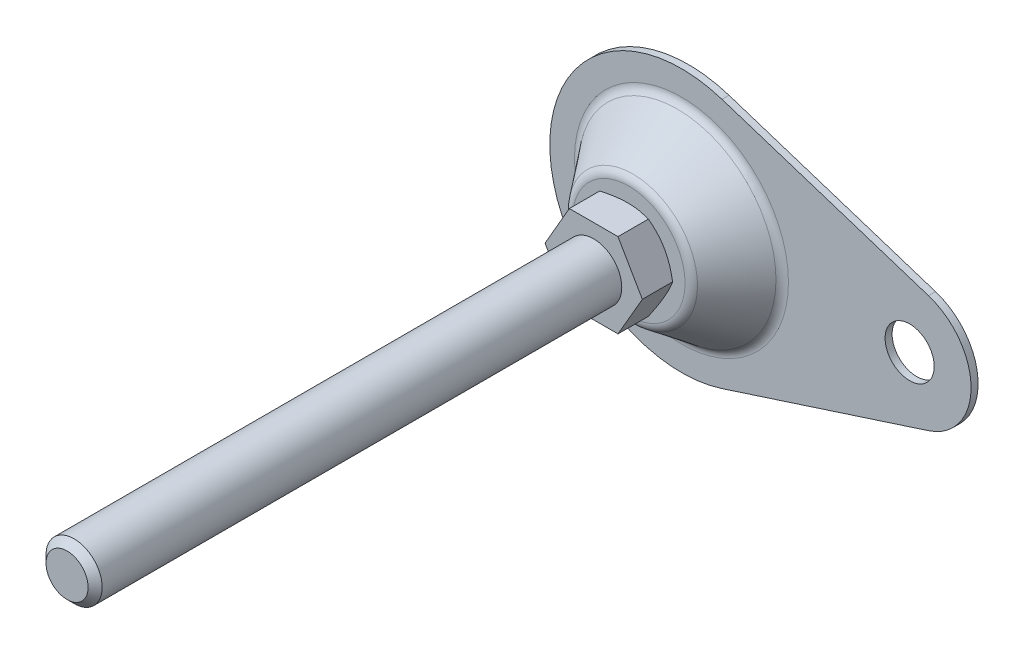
ISO-10303-21;
HEADER;
FILE_DESCRIPTION(('STEP AP214'),'2;1');
FILE_NAME('part.step','',(''),(''),'','','');
FILE_SCHEMA(('AUTOMOTIVE_DESIGN { 1 0 10303 214 1 1 1 1 }'));
ENDSEC;
DATA;
#1=APPLICATION_CONTEXT('core data for automotive mechanical design processes');
#2=APPLICATION_PROTOCOL_DEFINITION('international standard','automotive_design',2000,#1);
#3=PRODUCT_CONTEXT('',#1,'mechanical');
#4=PRODUCT('Part','Part','',(#3));
#5=PRODUCT_RELATED_PRODUCT_CATEGORY('part','',(#4));
#6=PRODUCT_DEFINITION_FORMATION('','',#4);
#7=PRODUCT_DEFINITION_CONTEXT('part definition',#1,'design');
#8=PRODUCT_DEFINITION('design','',#6,#7);
#9=PRODUCT_DEFINITION_SHAPE('','',#8);
#10=(LENGTH_UNIT() NAMED_UNIT(*) SI_UNIT(.MILLI.,.METRE.));
#11=(NAMED_UNIT(*) PLANE_ANGLE_UNIT() SI_UNIT($,.RADIAN.));
#12=(NAMED_UNIT(*) SI_UNIT($,.STERADIAN.) SOLID_ANGLE_UNIT());
#13=UNCERTAINTY_MEASURE_WITH_UNIT(LENGTH_MEASURE(1.E-05),#10,'distance_accuracy_value','');
#14=(GEOMETRIC_REPRESENTATION_CONTEXT(3) GLOBAL_UNCERTAINTY_ASSIGNED_CONTEXT((#13)) GLOBAL_UNIT_ASSIGNED_CONTEXT((#10,
#11,#12)) REPRESENTATION_CONTEXT('',''));
#15=CARTESIAN_POINT('',(0.,0.,0.));
#16=DIRECTION('',(0.,0.,1.));
#17=DIRECTION('',(1.,0.,0.));
#18=AXIS2_PLACEMENT_3D('',#15,#16,#17);
#19=CARTESIAN_POINT('',(65.,0.,2.));
#20=DIRECTION('',(0.,0.,1.));
#21=DIRECTION('',(1.,0.,0.));
#22=AXIS2_PLACEMENT_3D('',#19,#20,#21);
#23=PLANE('',#22);
#24=CARTESIAN_POINT('',(0.,0.,2.));
#25=DIRECTION('',(0.,0.,1.));
#26=DIRECTION('',(1.,0.,0.));
#27=AXIS2_PLACEMENT_3D('',#24,#25,#26);
#28=CIRCLE('',#27,30.4802116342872);
#29=CARTESIAN_POINT('',(30.4802116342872,0.,2.));
#30=VERTEX_POINT('',#29);
#31=EDGE_CURVE('E244',#30,#30,#28,.F.);
#32=ORIENTED_EDGE('',*,*,#31,.T.);
#33=EDGE_LOOP('',(#32));
#34=FACE_BOUND('',#33,.T.);
#35=CARTESIAN_POINT('',(65.,0.,2.));
#36=DIRECTION('',(0.,0.,1.));
#37=DIRECTION('',(1.,0.,0.));
#38=AXIS2_PLACEMENT_3D('',#35,#36,#37);
#39=CIRCLE('',#38,7.);
#40=CARTESIAN_POINT('',(72.,0.,2.));
#41=VERTEX_POINT('',#40);
#42=EDGE_CURVE('E261',#41,#41,#39,.T.);
#43=ORIENTED_EDGE('',*,*,#42,.F.);
#44=EDGE_LOOP('',(#43));
#45=FACE_BOUND('',#44,.T.);
#46=DIRECTION('',(-0.951485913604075,0.307692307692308,0.));
#47=VECTOR('',#46,1.);
#48=CARTESIAN_POINT('',(11.5384615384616,35.6807217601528,2.));
#49=LINE('',#48,#47);
#50=CARTESIAN_POINT('',(70.3846153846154,16.6510034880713,2.));
#51=VERTEX_POINT('',#50);
#52=CARTESIAN_POINT('',(11.5384615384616,35.6807217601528,2.));
#53=VERTEX_POINT('',#52);
#54=EDGE_CURVE('E112',#51,#53,#49,.T.);
#55=ORIENTED_EDGE('',*,*,#54,.T.);
#56=CARTESIAN_POINT('',(0.,0.,2.));
#57=DIRECTION('',(0.,0.,1.));
#58=DIRECTION('',(1.,0.,0.));
#59=AXIS2_PLACEMENT_3D('',#56,#57,#58);
#60=CIRCLE('',#59,37.5);
#61=CARTESIAN_POINT('',(11.5384615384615,-35.6807217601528,2.));
#62=VERTEX_POINT('',#61);
#63=EDGE_CURVE('E114',#53,#62,#60,.T.);
#64=ORIENTED_EDGE('',*,*,#63,.T.);
#65=DIRECTION('',(0.951485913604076,0.307692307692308,0.));
#66=VECTOR('',#65,1.);
#67=CARTESIAN_POINT('',(11.5384615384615,-35.6807217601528,2.));
#68=LINE('',#67,#66);
#69=CARTESIAN_POINT('',(70.3846153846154,-16.6510034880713,2.));
#70=VERTEX_POINT('',#69);
#71=EDGE_CURVE('E97',#62,#70,#68,.T.);
#72=ORIENTED_EDGE('',*,*,#71,.T.);
#73=CARTESIAN_POINT('',(65.,0.,2.));
#74=DIRECTION('',(0.,0.,1.));
#75=DIRECTION('',(1.,0.,0.));
#76=AXIS2_PLACEMENT_3D('',#73,#74,#75);
#77=CIRCLE('',#76,17.5);
#78=EDGE_CURVE('E106',#70,#51,#77,.T.);
#79=ORIENTED_EDGE('',*,*,#78,.T.);
#80=EDGE_LOOP('',(#55,#64,#72,#79));
#81=FACE_BOUND('',#80,.T.);
#82=ADVANCED_FACE('F14',(#34,#45,#81),#23,.T.);
#83=CARTESIAN_POINT('',(65.,0.,0.));
#84=DIRECTION('',(0.,0.,1.));
#85=DIRECTION('',(1.,0.,0.));
#86=AXIS2_PLACEMENT_3D('',#83,#84,#85);
#87=PLANE('',#86);
#88=CARTESIAN_POINT('',(65.,0.,0.));
#89=DIRECTION('',(0.,0.,1.));
#90=DIRECTION('',(1.,0.,0.));
#91=AXIS2_PLACEMENT_3D('',#88,#89,#90);
#92=CIRCLE('',#91,7.);
#93=CARTESIAN_POINT('',(72.,0.,0.));
#94=VERTEX_POINT('',#93);
#95=EDGE_CURVE('E257',#94,#94,#92,.T.);
#96=ORIENTED_EDGE('',*,*,#95,.T.);
#97=EDGE_LOOP('',(#96));
#98=FACE_BOUND('',#97,.T.);
#99=CARTESIAN_POINT('',(0.,0.,0.));
#100=DIRECTION('',(0.,0.,1.));
#101=DIRECTION('',(1.,0.,0.));
#102=AXIS2_PLACEMENT_3D('',#99,#100,#101);
#103=CIRCLE('',#102,37.5);
#104=CARTESIAN_POINT('',(11.5384615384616,35.6807217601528,0.));
#105=VERTEX_POINT('',#104);
#106=CARTESIAN_POINT('',(11.5384615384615,-35.6807217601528,0.));
#107=VERTEX_POINT('',#106);
#108=EDGE_CURVE('E274',#105,#107,#103,.T.);
#109=ORIENTED_EDGE('',*,*,#108,.F.);
#110=DIRECTION('',(-0.951485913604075,0.307692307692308,0.));
#111=VECTOR('',#110,1.);
#112=CARTESIAN_POINT('',(70.3846153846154,16.6510034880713,0.));
#113=LINE('',#112,#111);
#114=CARTESIAN_POINT('',(70.3846153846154,16.6510034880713,0.));
#115=VERTEX_POINT('',#114);
#116=EDGE_CURVE('E9',#115,#105,#113,.T.);
#117=ORIENTED_EDGE('',*,*,#116,.F.);
#118=CARTESIAN_POINT('',(65.,0.,0.));
#119=DIRECTION('',(0.,0.,1.));
#120=DIRECTION('',(1.,0.,0.));
#121=AXIS2_PLACEMENT_3D('',#118,#119,#120);
#122=CIRCLE('',#121,17.5);
#123=CARTESIAN_POINT('',(70.3846153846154,-16.6510034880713,0.));
#124=VERTEX_POINT('',#123);
#125=EDGE_CURVE('E22',#124,#115,#122,.T.);
#126=ORIENTED_EDGE('',*,*,#125,.F.);
#127=DIRECTION('',(0.951485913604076,0.307692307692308,0.));
#128=VECTOR('',#127,1.);
#129=CARTESIAN_POINT('',(70.3846153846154,-16.6510034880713,0.));
#130=LINE('',#129,#128);
#131=EDGE_CURVE('E99',#107,#124,#130,.T.);
#132=ORIENTED_EDGE('',*,*,#131,.F.);
#133=EDGE_LOOP('',(#109,#117,#126,#132));
#134=FACE_BOUND('',#133,.T.);
#135=ADVANCED_FACE('F215',(#98,#134),#87,.F.);
#136=CARTESIAN_POINT('',(0.,0.,17.));
#137=DIRECTION('',(0.,0.,-1.));
#138=DIRECTION('',(-1.,0.,0.));
#139=AXIS2_PLACEMENT_3D('',#136,#137,#138);
#140=PLANE('',#139);
#141=CARTESIAN_POINT('',(0.,0.,17.));
#142=DIRECTION('',(0.,0.,-1.));
#143=DIRECTION('',(-1.,0.,0.));
#144=AXIS2_PLACEMENT_3D('',#141,#142,#143);
#145=CIRCLE('',#144,16.0197883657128);
#146=CARTESIAN_POINT('',(-16.0197883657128,0.,17.));
#147=VERTEX_POINT('',#146);
#148=EDGE_CURVE('E277',#147,#147,#145,.F.);
#149=ORIENTED_EDGE('',*,*,#148,.T.);
#150=EDGE_LOOP('',(#149));
#151=FACE_BOUND('',#150,.T.);
#152=CARTESIAN_POINT('',(0.,0.,17.));
#153=DIRECTION('',(0.,0.,-1.));
#154=DIRECTION('',(-1.,0.,0.));
#155=AXIS2_PLACEMENT_3D('',#152,#153,#154);
#156=CIRCLE('',#155,11.5);
#157=CARTESIAN_POINT('',(-11.5,0.,17.));
#158=VERTEX_POINT('',#157);
#159=EDGE_CURVE('E122',#158,#158,#156,.T.);
#160=ORIENTED_EDGE('',*,*,#159,.T.);
#161=EDGE_LOOP('',(#160));
#162=FACE_BOUND('',#161,.T.);
#163=ADVANCED_FACE('F211',(#151,#162),#140,.F.);
#164=CARTESIAN_POINT('',(0.,0.,5.));
#165=DIRECTION('',(0.,0.,1.));
#166=DIRECTION('',(1.,0.,0.));
#167=AXIS2_PLACEMENT_3D('',#164,#165,#166);
#168=TOROIDAL_SURFACE('',#167,30.4802116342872,3.);
#169=CARTESIAN_POINT('',(0.,0.,3.1747053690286));
#170=DIRECTION('',(0.,0.,1.));
#171=DIRECTION('',(1.,0.,0.));
#172=AXIS2_PLACEMENT_3D('',#169,#170,#171);
#173=CIRCLE('',#172,28.0993925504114);
#174=CARTESIAN_POINT('',(28.0993925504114,0.,3.1747053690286));
#175=VERTEX_POINT('',#174);
#176=EDGE_CURVE('E241',#175,#175,#173,.T.);
#177=ORIENTED_EDGE('',*,*,#176,.F.);
#178=EDGE_LOOP('',(#177));
#179=FACE_BOUND('',#178,.T.);
#180=ORIENTED_EDGE('',*,*,#31,.F.);
#181=EDGE_LOOP('',(#180));
#182=FACE_BOUND('',#181,.T.);
#183=ADVANCED_FACE('F214',(#179,#182),#168,.F.);
#184=CARTESIAN_POINT('',(0.,0.,14.));
#185=DIRECTION('',(0.,0.,-1.));
#186=DIRECTION('',(-1.,0.,0.));
#187=AXIS2_PLACEMENT_3D('',#184,#185,#186);
#188=TOROIDAL_SURFACE('',#187,16.0197883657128,3.);
#189=ORIENTED_EDGE('',*,*,#148,.F.);
#190=EDGE_LOOP('',(#189));
#191=FACE_BOUND('',#190,.T.);
#192=CARTESIAN_POINT('',(0.,0.,15.8252946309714));
#193=DIRECTION('',(0.,0.,1.));
#194=DIRECTION('',(1.,0.,0.));
#195=AXIS2_PLACEMENT_3D('',#192,#193,#194);
#196=CIRCLE('',#195,18.4006074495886);
#197=CARTESIAN_POINT('',(18.4006074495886,0.,15.8252946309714));
#198=VERTEX_POINT('',#197);
#199=EDGE_CURVE('E250',#198,#198,#196,.F.);
#200=ORIENTED_EDGE('',*,*,#199,.F.);
#201=EDGE_LOOP('',(#200));
#202=FACE_BOUND('',#201,.T.);
#203=ADVANCED_FACE('F229',(#191,#202),#188,.T.);
#204=CARTESIAN_POINT('',(0.,0.,2.));
#205=DIRECTION('',(0.,0.,-1.));
#206=DIRECTION('',(-1.,0.,0.));
#207=AXIS2_PLACEMENT_3D('',#204,#205,#206);
#208=CYLINDRICAL_SURFACE('',#207,37.5);
#209=ORIENTED_EDGE('',*,*,#108,.T.);
#210=DIRECTION('',(0.,0.,1.));
#211=VECTOR('',#210,1.);
#212=CARTESIAN_POINT('',(11.5384615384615,-35.6807217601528,-8.));
#213=LINE('',#212,#211);
#214=EDGE_CURVE('E103',#107,#62,#213,.T.);
#215=ORIENTED_EDGE('',*,*,#214,.T.);
#216=ORIENTED_EDGE('',*,*,#63,.F.);
#217=DIRECTION('',(0.,0.,1.));
#218=VECTOR('',#217,1.);
#219=CARTESIAN_POINT('',(11.5384615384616,35.6807217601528,-8.));
#220=LINE('',#219,#218);
#221=EDGE_CURVE('E119',#105,#53,#220,.T.);
#222=ORIENTED_EDGE('',*,*,#221,.F.);
#223=EDGE_LOOP('',(#209,#215,#216,#222));
#224=FACE_BOUND('',#223,.T.);
#225=ADVANCED_FACE('F219',(#224),#208,.T.);
#226=CARTESIAN_POINT('',(65.,0.,2.));
#227=DIRECTION('',(0.,0.,-1.));
#228=DIRECTION('',(-1.,0.,0.));
#229=AXIS2_PLACEMENT_3D('',#226,#227,#228);
#230=CYLINDRICAL_SURFACE('',#229,7.);
#231=ORIENTED_EDGE('',*,*,#42,.T.);
#232=EDGE_LOOP('',(#231));
#233=FACE_BOUND('',#232,.T.);
#234=ORIENTED_EDGE('',*,*,#95,.F.);
#235=EDGE_LOOP('',(#234));
#236=FACE_BOUND('',#235,.T.);
#237=ADVANCED_FACE('F209',(#233,#236),#230,.F.);
#238=CARTESIAN_POINT('',(0.,0.,2.));
#239=DIRECTION('',(0.,0.,-1.));
#240=DIRECTION('',(-1.,0.,0.));
#241=AXIS2_PLACEMENT_3D('',#238,#239,#240);
#242=CONICAL_SURFACE('',#241,29.,0.654082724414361);
#243=ORIENTED_EDGE('',*,*,#176,.T.);
#244=EDGE_LOOP('',(#243));
#245=FACE_BOUND('',#244,.T.);
#246=ORIENTED_EDGE('',*,*,#199,.T.);
#247=EDGE_LOOP('',(#246));
#248=FACE_BOUND('',#247,.T.);
#249=ADVANCED_FACE('F151',(#245,#248),#242,.T.);
#250=CARTESIAN_POINT('',(0.,0.,17.));
#251=DIRECTION('',(0.,0.,1.));
#252=DIRECTION('',(1.,0.,0.));
#253=AXIS2_PLACEMENT_3D('',#250,#251,#252);
#254=CONICAL_SURFACE('',#253,11.5,1.0471975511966);
#255=ORIENTED_EDGE('',*,*,#159,.F.);
#256=EDGE_LOOP('',(#255));
#257=FACE_BOUND('',#256,.T.);
#258=CARTESIAN_POINT('',(13.8565219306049,0.000200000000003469,18.3605385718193));
#259=CARTESIAN_POINT('',(13.7042251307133,-0.263585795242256,18.2726247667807));
#260=CARTESIAN_POINT('',(13.5513604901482,-0.528355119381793,18.1887011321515));
#261=CARTESIAN_POINT('',(13.244405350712,-1.06001701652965,18.0299413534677));
#262=CARTESIAN_POINT('',(13.0903144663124,-1.32691025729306,17.9551081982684));
#263=CARTESIAN_POINT('',(12.6255589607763,-2.131890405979,17.745692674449));
#264=CARTESIAN_POINT('',(12.3130596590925,-2.67315507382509,17.6265783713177));
#265=CARTESIAN_POINT('',(11.8454187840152,-3.48313282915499,17.486906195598));
#266=CARTESIAN_POINT('',(11.6916742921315,-3.74942610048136,17.4471189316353));
#267=CARTESIAN_POINT('',(11.3834734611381,-4.28324559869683,17.3803985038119));
#268=CARTESIAN_POINT('',(11.2290171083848,-4.55077184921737,17.3534655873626));
#269=CARTESIAN_POINT('',(10.9198468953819,-5.08627036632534,17.3131437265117));
#270=CARTESIAN_POINT('',(10.7651335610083,-5.35424172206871,17.2997386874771));
#271=CARTESIAN_POINT('',(10.4555635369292,-5.89043273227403,17.286758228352));
#272=CARTESIAN_POINT('',(10.3007068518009,-6.15865237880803,17.2871823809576));
#273=CARTESIAN_POINT('',(10.0112020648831,-6.6600893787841,17.3008951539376));
#274=CARTESIAN_POINT('',(9.87653331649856,-6.89334249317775,17.3125111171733));
#275=CARTESIAN_POINT('',(9.60750555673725,-7.35931224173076,17.3459831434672));
#276=CARTESIAN_POINT('',(9.47314656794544,-7.59202883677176,17.367839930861));
#277=CARTESIAN_POINT('',(9.2048113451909,-8.05679907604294,17.4214125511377));
#278=CARTESIAN_POINT('',(9.07083551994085,-8.28885201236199,17.4531365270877));
#279=CARTESIAN_POINT('',(8.80351197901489,-8.75186996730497,17.5258869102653));
#280=CARTESIAN_POINT('',(8.67016430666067,-8.98283491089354,17.566913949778));
#281=CARTESIAN_POINT('',(8.2653799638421,-9.68394195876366,17.7049867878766));
#282=CARTESIAN_POINT('',(7.99511549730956,-10.1520537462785,17.8158000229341));
#283=CARTESIAN_POINT('',(7.45861659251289,-11.0812971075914,18.0673009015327));
#284=CARTESIAN_POINT('',(7.19237528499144,-11.5424405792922,18.2079294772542));
#285=CARTESIAN_POINT('',(6.92808776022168,-12.0002,18.3605385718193));
#286=B_SPLINE_CURVE_WITH_KNOTS('',3,(#258,#259,#260,#261,#262,#263,#264,#265,#266,#267,#268,
#269,#270,#271,#272,#273,#274,#275,#276,#277,#278,#279,#280,#281,#282,#283,#284,#285),
.UNSPECIFIED.,.F.,.F.,(4,2,2,2,2,2,2,2,2,2,2,2,2,4),(0.,0.951004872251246,1.90232158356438,
3.80900466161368,4.7389455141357,5.66890426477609,6.59775529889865,7.5265776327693,
8.33514643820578,9.14377244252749,9.95306755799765,10.7624176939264,12.4167102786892,
14.0677556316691),.UNSPECIFIED.);
#287=CARTESIAN_POINT('',(13.856406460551,0.,18.3604719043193));
#288=VERTEX_POINT('',#287);
#289=CARTESIAN_POINT('',(6.92820323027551,-12.,18.3604719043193));
#290=VERTEX_POINT('',#289);
#291=EDGE_CURVE('E29',#288,#290,#286,.T.);
#292=ORIENTED_EDGE('',*,*,#291,.T.);
#293=CARTESIAN_POINT('',(-18.6083655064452,-12.,23.1442020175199));
#294=CARTESIAN_POINT('',(-18.3462770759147,-12.,23.017036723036));
#295=CARTESIAN_POINT('',(-18.08388099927,-12.,22.8905057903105));
#296=CARTESIAN_POINT('',(-17.5584093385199,-12.,22.6388563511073));
#297=CARTESIAN_POINT('',(-17.2953337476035,-12.,22.5137378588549));
#298=CARTESIAN_POINT('',(-16.5049212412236,-12.,22.1406835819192));
#299=CARTESIAN_POINT('',(-15.9764762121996,-12.,21.8950867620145));
#300=CARTESIAN_POINT('',(-14.9131727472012,-12.,21.4102942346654));
#301=CARTESIAN_POINT('',(-14.3782950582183,-12.,21.1711406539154));
#302=CARTESIAN_POINT('',(-13.3042843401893,-12.,20.7026217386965));
#303=CARTESIAN_POINT('',(-12.7651515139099,-12.,20.4732559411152));
#304=CARTESIAN_POINT('',(-11.6645656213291,-12.,20.0198140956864));
#305=CARTESIAN_POINT('',(-11.1029472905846,-12.,19.796137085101));
#306=CARTESIAN_POINT('',(-9.97313609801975,-12.,19.365714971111));
#307=CARTESIAN_POINT('',(-9.40494250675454,-12.,19.1589717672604));
#308=CARTESIAN_POINT('',(-8.26215847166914,-12.,18.76784755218));
#309=CARTESIAN_POINT('',(-7.68758363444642,-12.,18.5834213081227));
#310=CARTESIAN_POINT('',(-6.5301387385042,-12.,18.2428386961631));
#311=CARTESIAN_POINT('',(-5.94727135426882,-12.,18.08667342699));
#312=CARTESIAN_POINT('',(-5.06821126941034,-12.,17.8796863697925));
#313=CARTESIAN_POINT('',(-4.77517718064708,-12.,17.8153682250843));
#314=CARTESIAN_POINT('',(-4.18710701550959,-12.,17.6965924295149));
#315=CARTESIAN_POINT('',(-3.89207098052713,-12.,17.6421345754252));
#316=CARTESIAN_POINT('',(-3.30020139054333,-12.,17.5440409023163));
#317=CARTESIAN_POINT('',(-3.00336786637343,-12.,17.5004048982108));
#318=CARTESIAN_POINT('',(-2.40821714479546,-12.,17.4248252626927));
#319=CARTESIAN_POINT('',(-2.10990000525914,-12.,17.3928811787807));
#320=CARTESIAN_POINT('',(-1.51609597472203,-12.,17.3417206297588));
#321=CARTESIAN_POINT('',(-1.22062302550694,-12.,17.3223433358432));
#322=CARTESIAN_POINT('',(-0.629123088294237,-12.,17.2961009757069));
#323=CARTESIAN_POINT('',(-0.333096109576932,-12.,17.289235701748));
#324=CARTESIAN_POINT('',(0.258986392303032,-12.,17.2881806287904));
#325=CARTESIAN_POINT('',(0.555041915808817,-12.,17.2939910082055));
#326=CARTESIAN_POINT('',(1.14664467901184,-12.,17.3181459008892));
#327=CARTESIAN_POINT('',(1.44219189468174,-12.,17.3364909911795));
#328=CARTESIAN_POINT('',(2.15236846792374,-12.,17.3952444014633));
#329=CARTESIAN_POINT('',(2.5665149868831,-12.,17.4415931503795));
#330=CARTESIAN_POINT('',(3.39173719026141,-12.,17.5563807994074));
#331=CARTESIAN_POINT('',(3.802812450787,-12.,17.6248226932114));
#332=CARTESIAN_POINT('',(4.62149256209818,-12.,17.781362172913));
#333=CARTESIAN_POINT('',(5.02909452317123,-12.,17.8694747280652));
#334=CARTESIAN_POINT('',(5.84021237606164,-12.,18.062669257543));
#335=CARTESIAN_POINT('',(6.24372832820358,-12.,18.1677509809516));
#336=CARTESIAN_POINT('',(7.05587544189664,-12.,18.3949035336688));
#337=CARTESIAN_POINT('',(7.46441269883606,-12.,18.5173077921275));
#338=CARTESIAN_POINT('',(8.27746088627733,-12.,18.7747613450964));
#339=CARTESIAN_POINT('',(8.68197178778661,-12.,18.9098107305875));
#340=CARTESIAN_POINT('',(9.4871716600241,-12.,19.1904097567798));
#341=CARTESIAN_POINT('',(9.887861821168,-12.,19.3359559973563));
#342=CARTESIAN_POINT('',(10.6859173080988,-12.,19.6358360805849));
#343=CARTESIAN_POINT('',(11.0832826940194,-12.,19.790169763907));
#344=CARTESIAN_POINT('',(12.1042233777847,-12.,20.1976080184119));
#345=CARTESIAN_POINT('',(12.7256146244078,-12.,20.4561802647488));
#346=CARTESIAN_POINT('',(13.9624742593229,-12.,20.987167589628));
#347=CARTESIAN_POINT('',(14.5779421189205,-12.,21.2595838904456));
#348=CARTESIAN_POINT('',(15.8042277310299,-12.,21.8151533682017));
#349=CARTESIAN_POINT('',(16.4150439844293,-12.,22.0983098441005));
#350=CARTESIAN_POINT('',(17.6327206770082,-12.,22.6729304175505));
#351=CARTESIAN_POINT('',(18.2395812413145,-12.,22.96439425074));
#352=CARTESIAN_POINT('',(19.4509184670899,-12.,23.5543128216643));
#353=CARTESIAN_POINT('',(20.0553907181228,-12.,23.852776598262));
#354=CARTESIAN_POINT('',(21.2616889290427,-12.,24.4550062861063));
#355=CARTESIAN_POINT('',(21.8635148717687,-12.,24.7587722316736));
#356=CARTESIAN_POINT('',(23.0648638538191,-12.,25.3705559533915));
#357=CARTESIAN_POINT('',(23.6643872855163,-12.,25.6785729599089));
#358=CARTESIAN_POINT('',(24.8616006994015,-12.,26.2981517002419));
#359=CARTESIAN_POINT('',(25.4592906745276,-12.,26.6097134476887));
#360=CARTESIAN_POINT('',(27.1338285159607,-12.,27.4878442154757));
#361=CARTESIAN_POINT('',(28.2089405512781,-12.,28.0577228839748));
#362=CARTESIAN_POINT('',(30.3554827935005,-12.,29.204483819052));
#363=CARTESIAN_POINT('',(31.4269128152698,-12.,29.781366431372));
#364=CARTESIAN_POINT('',(33.5637741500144,-12.,30.9386998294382));
#365=CARTESIAN_POINT('',(34.6292138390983,-12.,31.5191351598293));
#366=CARTESIAN_POINT('',(36.2256750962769,-12.,32.392803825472));
#367=CARTESIAN_POINT('',(36.7575282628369,-12.,32.6845196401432));
#368=CARTESIAN_POINT('',(37.8207382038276,-12.,33.2688529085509));
#369=CARTESIAN_POINT('',(38.3520949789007,-12.,33.5614703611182));
#370=CARTESIAN_POINT('',(38.8832332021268,-12.,33.8544840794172));
#371=B_SPLINE_CURVE_WITH_KNOTS('',3,(#293,#294,#295,#296,#297,#298,#299,#300,#301,#302,#303,
#304,#305,#306,#307,#308,#309,#310,#311,#312,#313,#314,#315,#316,#317,#318,#319,#320,#321,#322,
#323,#324,#325,#326,#327,#328,#329,#330,#331,#332,#333,#334,#335,#336,#337,#338,#339,#340,#341,
#342,#343,#344,#345,#346,#347,#348,#349,#350,#351,#352,#353,#354,#355,#356,#357,#358,#359,#360,
#361,#362,#363,#364,#365,#366,#367,#368,#369,#370),.UNSPECIFIED.,.F.,.F.,(4,2,2,2,2,2,2,2,2,2,2,
2,2,2,2,2,2,2,2,2,2,2,2,2,2,2,2,2,2,2,2,2,2,2,2,2,2,2,4),(0.,0.873927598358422,1.74786399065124,
3.49599571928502,5.25364432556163,7.01120967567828,8.82456645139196,10.6381263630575,
12.4479466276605,14.2571958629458,15.1570857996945,16.0569571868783,16.9568131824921,
17.8566343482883,18.7446997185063,19.6327503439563,20.5208134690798,21.408917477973,
22.6584225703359,23.9080970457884,25.1587257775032,26.4093360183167,27.6885323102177,
28.9677378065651,30.2465307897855,31.5253005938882,33.5441851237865,35.5632482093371,
37.5829365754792,39.6025607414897,41.6249545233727,43.6473614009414,45.6694068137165,
47.6914600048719,51.341851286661,54.9924235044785,58.6322742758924,60.4520794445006,
62.271882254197),.UNSPECIFIED.);
#372=CARTESIAN_POINT('',(-6.92820323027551,-12.,18.3604719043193));
#373=VERTEX_POINT('',#372);
#374=EDGE_CURVE('E158',#290,#373,#371,.F.);
#375=ORIENTED_EDGE('',*,*,#374,.T.);
#376=CARTESIAN_POINT('',(-6.92808776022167,-12.0002,18.3605385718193));
#377=CARTESIAN_POINT('',(-7.08038456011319,-11.7364142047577,18.2726247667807));
#378=CARTESIAN_POINT('',(-7.23324920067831,-11.4716448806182,18.1887011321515));
#379=CARTESIAN_POINT('',(-7.5402043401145,-10.9399829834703,18.0299413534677));
#380=CARTESIAN_POINT('',(-7.69429522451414,-10.6730897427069,17.9551081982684));
#381=CARTESIAN_POINT('',(-8.15905073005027,-9.868109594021,17.745692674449));
#382=CARTESIAN_POINT('',(-8.47155003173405,-9.32684492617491,17.6265783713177));
#383=CARTESIAN_POINT('',(-8.93919090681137,-8.51686717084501,17.486906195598));
#384=CARTESIAN_POINT('',(-9.09293539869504,-8.25057389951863,17.4471189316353));
#385=CARTESIAN_POINT('',(-9.40113622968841,-7.71675440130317,17.3803985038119));
#386=CARTESIAN_POINT('',(-9.55559258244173,-7.44922815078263,17.3534655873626));
#387=CARTESIAN_POINT('',(-9.86476279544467,-6.91372963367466,17.3131437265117));
#388=CARTESIAN_POINT('',(-10.0194761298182,-6.64575827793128,17.2997386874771));
#389=CARTESIAN_POINT('',(-10.3290461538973,-6.10956726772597,17.286758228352));
#390=CARTESIAN_POINT('',(-10.4839028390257,-5.84134762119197,17.2871823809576));
#391=CARTESIAN_POINT('',(-10.7734076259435,-5.3399106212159,17.3008951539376));
#392=CARTESIAN_POINT('',(-10.908076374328,-5.10665750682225,17.3125111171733));
#393=CARTESIAN_POINT('',(-11.1771041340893,-4.64068775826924,17.3459831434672));
#394=CARTESIAN_POINT('',(-11.3114631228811,-4.40797116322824,17.367839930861));
#395=CARTESIAN_POINT('',(-11.5797983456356,-3.94320092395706,17.4214125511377));
#396=CARTESIAN_POINT('',(-11.7137741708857,-3.711147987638,17.4531365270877));
#397=CARTESIAN_POINT('',(-11.9810977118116,-3.24813003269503,17.5258869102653));
#398=CARTESIAN_POINT('',(-12.1144453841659,-3.01716508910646,17.566913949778));
#399=CARTESIAN_POINT('',(-12.5192297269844,-2.31605804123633,17.7049867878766));
#400=CARTESIAN_POINT('',(-12.789494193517,-1.84794625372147,17.8158000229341));
#401=CARTESIAN_POINT('',(-13.3259930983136,-0.91870289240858,18.0673009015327));
#402=CARTESIAN_POINT('',(-13.5922344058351,-0.457559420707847,18.2079294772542));
#403=CARTESIAN_POINT('',(-13.8565219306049,0.000199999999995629,18.3605385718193));
#404=B_SPLINE_CURVE_WITH_KNOTS('',3,(#376,#377,#378,#379,#380,#381,#382,#383,#384,#385,#386,
#387,#388,#389,#390,#391,#392,#393,#394,#395,#396,#397,#398,#399,#400,#401,#402,#403),
.UNSPECIFIED.,.F.,.F.,(4,2,2,2,2,2,2,2,2,2,2,2,2,4),(0.,0.951004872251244,1.90232158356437,
3.80900466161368,4.7389455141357,5.66890426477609,6.59775529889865,7.5265776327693,
8.33514643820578,9.14377244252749,9.95306755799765,10.7624176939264,12.4167102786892,
14.0677556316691),.UNSPECIFIED.);
#405=CARTESIAN_POINT('',(-13.856406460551,0.,18.3604719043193));
#406=VERTEX_POINT('',#405);
#407=EDGE_CURVE('E127',#373,#406,#404,.T.);
#408=ORIENTED_EDGE('',*,*,#407,.T.);
#409=CARTESIAN_POINT('',(-13.8565219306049,-0.000200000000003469,18.3605385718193));
#410=CARTESIAN_POINT('',(-13.7042251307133,0.26358579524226,18.2726247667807));
#411=CARTESIAN_POINT('',(-13.5513604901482,0.528355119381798,18.1887011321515));
#412=CARTESIAN_POINT('',(-13.244405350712,1.06001701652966,18.0299413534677));
#413=CARTESIAN_POINT('',(-13.0903144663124,1.32691025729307,17.9551081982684));
#414=CARTESIAN_POINT('',(-12.6255589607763,2.13189040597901,17.745692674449));
#415=CARTESIAN_POINT('',(-12.3130596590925,2.6731550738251,17.6265783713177));
#416=CARTESIAN_POINT('',(-11.8454187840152,3.483132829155,17.486906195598));
#417=CARTESIAN_POINT('',(-11.6916742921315,3.74942610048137,17.4471189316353));
#418=CARTESIAN_POINT('',(-11.3834734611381,4.28324559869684,17.3803985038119));
#419=CARTESIAN_POINT('',(-11.2290171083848,4.55077184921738,17.3534655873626));
#420=CARTESIAN_POINT('',(-10.9198468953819,5.08627036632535,17.3131437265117));
#421=CARTESIAN_POINT('',(-10.7651335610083,5.35424172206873,17.2997386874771));
#422=CARTESIAN_POINT('',(-10.4555635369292,5.89043273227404,17.286758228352));
#423=CARTESIAN_POINT('',(-10.3007068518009,6.15865237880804,17.2871823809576));
#424=CARTESIAN_POINT('',(-10.0112020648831,6.66008937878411,17.3008951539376));
#425=CARTESIAN_POINT('',(-9.87653331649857,6.89334249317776,17.3125111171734));
#426=CARTESIAN_POINT('',(-9.60750555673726,7.35931224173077,17.3459831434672));
#427=CARTESIAN_POINT('',(-9.47314656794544,7.59202883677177,17.367839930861));
#428=CARTESIAN_POINT('',(-9.20481134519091,8.05679907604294,17.4214125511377));
#429=CARTESIAN_POINT('',(-9.07083551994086,8.288852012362,17.4531365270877));
#430=CARTESIAN_POINT('',(-8.8035119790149,8.75186996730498,17.5258869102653));
#431=CARTESIAN_POINT('',(-8.67016430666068,8.98283491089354,17.566913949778));
#432=CARTESIAN_POINT('',(-8.26537996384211,9.68394195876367,17.7049867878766));
#433=CARTESIAN_POINT('',(-7.99511549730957,10.1520537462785,17.8158000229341));
#434=CARTESIAN_POINT('',(-7.4586165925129,11.0812971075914,18.0673009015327));
#435=CARTESIAN_POINT('',(-7.19237528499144,11.5424405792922,18.2079294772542));
#436=CARTESIAN_POINT('',(-6.92808776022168,12.0002,18.3605385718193));
#437=B_SPLINE_CURVE_WITH_KNOTS('',3,(#409,#410,#411,#412,#413,#414,#415,#416,#417,#418,#419,
#420,#421,#422,#423,#424,#425,#426,#427,#428,#429,#430,#431,#432,#433,#434,#435,#436),
.UNSPECIFIED.,.F.,.F.,(4,2,2,2,2,2,2,2,2,2,2,2,2,4),(0.,0.951004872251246,1.90232158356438,
3.80900466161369,4.7389455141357,5.66890426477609,6.59775529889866,7.52657763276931,
8.33514643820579,9.14377244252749,9.95306755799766,10.7624176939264,12.4167102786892,
14.0677556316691),.UNSPECIFIED.);
#438=CARTESIAN_POINT('',(-6.92820323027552,12.,18.3604719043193));
#439=VERTEX_POINT('',#438);
#440=EDGE_CURVE('E135',#406,#439,#437,.T.);
#441=ORIENTED_EDGE('',*,*,#440,.T.);
#442=CARTESIAN_POINT('',(-18.6083655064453,12.,23.1442020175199));
#443=CARTESIAN_POINT('',(-18.3462770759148,12.,23.017036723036));
#444=CARTESIAN_POINT('',(-18.08388099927,12.,22.8905057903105));
#445=CARTESIAN_POINT('',(-17.5584093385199,12.,22.6388563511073));
#446=CARTESIAN_POINT('',(-17.2953337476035,12.,22.5137378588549));
#447=CARTESIAN_POINT('',(-16.5049212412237,12.,22.1406835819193));
#448=CARTESIAN_POINT('',(-15.9764762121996,12.,21.8950867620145));
#449=CARTESIAN_POINT('',(-14.9131727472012,12.,21.4102942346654));
#450=CARTESIAN_POINT('',(-14.3782950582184,12.,21.1711406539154));
#451=CARTESIAN_POINT('',(-13.3042843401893,12.,20.7026217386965));
#452=CARTESIAN_POINT('',(-12.7651515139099,12.,20.4732559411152));
#453=CARTESIAN_POINT('',(-11.6645656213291,12.,20.0198140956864));
#454=CARTESIAN_POINT('',(-11.1029472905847,12.,19.796137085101));
#455=CARTESIAN_POINT('',(-9.97313609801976,12.,19.365714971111));
#456=CARTESIAN_POINT('',(-9.40494250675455,12.,19.1589717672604));
#457=CARTESIAN_POINT('',(-8.26215847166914,12.,18.76784755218));
#458=CARTESIAN_POINT('',(-7.68758363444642,12.,18.5834213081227));
#459=CARTESIAN_POINT('',(-6.5301387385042,12.,18.2428386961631));
#460=CARTESIAN_POINT('',(-5.94727135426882,12.,18.08667342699));
#461=CARTESIAN_POINT('',(-5.06821126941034,12.,17.8796863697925));
#462=CARTESIAN_POINT('',(-4.77517718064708,12.,17.8153682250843));
#463=CARTESIAN_POINT('',(-4.18710701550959,12.,17.6965924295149));
#464=CARTESIAN_POINT('',(-3.89207098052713,12.,17.6421345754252));
#465=CARTESIAN_POINT('',(-3.30020139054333,12.,17.5440409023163));
#466=CARTESIAN_POINT('',(-3.00336786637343,12.,17.5004048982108));
#467=CARTESIAN_POINT('',(-2.40821714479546,12.,17.4248252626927));
#468=CARTESIAN_POINT('',(-2.10990000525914,12.,17.3928811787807));
#469=CARTESIAN_POINT('',(-1.51609597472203,12.,17.3417206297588));
#470=CARTESIAN_POINT('',(-1.22062302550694,12.,17.3223433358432));
#471=CARTESIAN_POINT('',(-0.62912308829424,12.,17.2961009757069));
#472=CARTESIAN_POINT('',(-0.333096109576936,12.,17.289235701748));
#473=CARTESIAN_POINT('',(0.258986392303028,12.,17.2881806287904));
#474=CARTESIAN_POINT('',(0.555041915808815,12.,17.2939910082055));
#475=CARTESIAN_POINT('',(1.14664467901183,12.,17.3181459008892));
#476=CARTESIAN_POINT('',(1.44219189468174,12.,17.3364909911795));
#477=CARTESIAN_POINT('',(2.15236846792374,12.,17.3952444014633));
#478=CARTESIAN_POINT('',(2.5665149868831,12.,17.4415931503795));
#479=CARTESIAN_POINT('',(3.3917371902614,12.,17.5563807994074));
#480=CARTESIAN_POINT('',(3.80281245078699,12.,17.6248226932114));
#481=CARTESIAN_POINT('',(4.62149256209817,12.,17.781362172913));
#482=CARTESIAN_POINT('',(5.02909452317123,12.,17.8694747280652));
#483=CARTESIAN_POINT('',(5.84021237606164,12.,18.062669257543));
#484=CARTESIAN_POINT('',(6.24372832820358,12.,18.1677509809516));
#485=CARTESIAN_POINT('',(7.05587544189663,12.,18.3949035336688));
#486=CARTESIAN_POINT('',(7.46441269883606,12.,18.5173077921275));
#487=CARTESIAN_POINT('',(8.27746088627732,12.,18.7747613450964));
#488=CARTESIAN_POINT('',(8.68197178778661,12.,18.9098107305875));
#489=CARTESIAN_POINT('',(9.48717166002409,12.,19.1904097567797));
#490=CARTESIAN_POINT('',(9.88786182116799,12.,19.3359559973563));
#491=CARTESIAN_POINT('',(10.6859173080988,12.,19.6358360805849));
#492=CARTESIAN_POINT('',(11.0832826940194,12.,19.790169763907));
#493=CARTESIAN_POINT('',(12.1042233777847,12.,20.1976080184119));
#494=CARTESIAN_POINT('',(12.7256146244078,12.,20.4561802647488));
#495=CARTESIAN_POINT('',(13.9624742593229,12.,20.987167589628));
#496=CARTESIAN_POINT('',(14.5779421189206,12.,21.2595838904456));
#497=CARTESIAN_POINT('',(15.8042277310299,12.,21.8151533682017));
#498=CARTESIAN_POINT('',(16.4150439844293,12.,22.0983098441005));
#499=CARTESIAN_POINT('',(17.6327206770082,12.,22.6729304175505));
#500=CARTESIAN_POINT('',(18.2395812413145,12.,22.96439425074));
#501=CARTESIAN_POINT('',(19.4509184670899,12.,23.5543128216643));
#502=CARTESIAN_POINT('',(20.0553907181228,12.,23.852776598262));
#503=CARTESIAN_POINT('',(21.2616889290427,12.,24.4550062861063));
#504=CARTESIAN_POINT('',(21.8635148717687,12.,24.7587722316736));
#505=CARTESIAN_POINT('',(23.0648638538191,12.,25.3705559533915));
#506=CARTESIAN_POINT('',(23.6643872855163,12.,25.6785729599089));
#507=CARTESIAN_POINT('',(24.8616006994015,12.,26.2981517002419));
#508=CARTESIAN_POINT('',(25.4592906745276,12.,26.6097134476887));
#509=CARTESIAN_POINT('',(27.1338285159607,12.,27.4878442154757));
#510=CARTESIAN_POINT('',(28.2089405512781,12.,28.0577228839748));
#511=CARTESIAN_POINT('',(30.3554827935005,12.,29.204483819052));
#512=CARTESIAN_POINT('',(31.4269128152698,12.,29.781366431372));
#513=CARTESIAN_POINT('',(33.5637741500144,12.,30.9386998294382));
#514=CARTESIAN_POINT('',(34.6292138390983,12.,31.5191351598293));
#515=CARTESIAN_POINT('',(36.2256750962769,12.,32.392803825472));
#516=CARTESIAN_POINT('',(36.7575282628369,12.,32.6845196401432));
#517=CARTESIAN_POINT('',(37.8207382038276,12.,33.2688529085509));
#518=CARTESIAN_POINT('',(38.3520949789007,12.,33.5614703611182));
#519=CARTESIAN_POINT('',(38.8832332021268,12.,33.8544840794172));
#520=B_SPLINE_CURVE_WITH_KNOTS('',3,(#442,#443,#444,#445,#446,#447,#448,#449,#450,#451,#452,
#453,#454,#455,#456,#457,#458,#459,#460,#461,#462,#463,#464,#465,#466,#467,#468,#469,#470,#471,
#472,#473,#474,#475,#476,#477,#478,#479,#480,#481,#482,#483,#484,#485,#486,#487,#488,#489,#490,
#491,#492,#493,#494,#495,#496,#497,#498,#499,#500,#501,#502,#503,#504,#505,#506,#507,#508,#509,
#510,#511,#512,#513,#514,#515,#516,#517,#518,#519),.UNSPECIFIED.,.F.,.F.,(4,2,2,2,2,2,2,2,2,2,2,
2,2,2,2,2,2,2,2,2,2,2,2,2,2,2,2,2,2,2,2,2,2,2,2,2,2,2,4),(0.,0.873927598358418,1.74786399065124,
3.49599571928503,5.25364432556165,7.01120967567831,8.82456645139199,10.6381263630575,
12.4479466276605,14.2571958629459,15.1570857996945,16.0569571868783,16.9568131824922,
17.8566343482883,18.7446997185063,19.6327503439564,20.5208134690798,21.408917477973,
22.658422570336,23.9080970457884,25.1587257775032,26.4093360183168,27.6885323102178,
28.9677378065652,30.2465307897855,31.5253005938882,33.5441851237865,35.5632482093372,
37.5829365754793,39.6025607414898,41.6249545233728,43.6473614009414,45.6694068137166,
47.6914600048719,51.3418512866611,54.9924235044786,58.6322742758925,60.4520794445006,
62.2718822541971),.UNSPECIFIED.);
#521=CARTESIAN_POINT('',(6.92820323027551,12.,18.3604719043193));
#522=VERTEX_POINT('',#521);
#523=EDGE_CURVE('E169',#439,#522,#520,.T.);
#524=ORIENTED_EDGE('',*,*,#523,.T.);
#525=CARTESIAN_POINT('',(6.92808776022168,12.0002,18.3605385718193));
#526=CARTESIAN_POINT('',(7.0803845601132,11.7364142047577,18.2726247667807));
#527=CARTESIAN_POINT('',(7.23324920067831,11.4716448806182,18.1887011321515));
#528=CARTESIAN_POINT('',(7.5402043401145,10.9399829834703,18.0299413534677));
#529=CARTESIAN_POINT('',(7.69429522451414,10.6730897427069,17.9551081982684));
#530=CARTESIAN_POINT('',(8.15905073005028,9.86810959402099,17.745692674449));
#531=CARTESIAN_POINT('',(8.47155003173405,9.3268449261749,17.6265783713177));
#532=CARTESIAN_POINT('',(8.93919090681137,8.51686717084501,17.486906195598));
#533=CARTESIAN_POINT('',(9.09293539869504,8.25057389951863,17.4471189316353));
#534=CARTESIAN_POINT('',(9.40113622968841,7.71675440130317,17.3803985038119));
#535=CARTESIAN_POINT('',(9.55559258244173,7.44922815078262,17.3534655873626));
#536=CARTESIAN_POINT('',(9.86476279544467,6.91372963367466,17.3131437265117));
#537=CARTESIAN_POINT('',(10.0194761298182,6.64575827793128,17.2997386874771));
#538=CARTESIAN_POINT('',(10.3290461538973,6.10956726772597,17.286758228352));
#539=CARTESIAN_POINT('',(10.4839028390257,5.84134762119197,17.2871823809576));
#540=CARTESIAN_POINT('',(10.7734076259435,5.3399106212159,17.3008951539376));
#541=CARTESIAN_POINT('',(10.908076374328,5.10665750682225,17.3125111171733));
#542=CARTESIAN_POINT('',(11.1771041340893,4.64068775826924,17.3459831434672));
#543=CARTESIAN_POINT('',(11.3114631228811,4.40797116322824,17.367839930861));
#544=CARTESIAN_POINT('',(11.5797983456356,3.94320092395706,17.4214125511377));
#545=CARTESIAN_POINT('',(11.7137741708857,3.711147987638,17.4531365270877));
#546=CARTESIAN_POINT('',(11.9810977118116,3.24813003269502,17.5258869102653));
#547=CARTESIAN_POINT('',(12.1144453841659,3.01716508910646,17.566913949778));
#548=CARTESIAN_POINT('',(12.5192297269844,2.31605804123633,17.7049867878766));
#549=CARTESIAN_POINT('',(12.789494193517,1.84794625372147,17.8158000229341));
#550=CARTESIAN_POINT('',(13.3259930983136,0.91870289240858,18.0673009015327));
#551=CARTESIAN_POINT('',(13.5922344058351,0.457559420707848,18.2079294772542));
#552=CARTESIAN_POINT('',(13.8565219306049,-0.000199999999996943,18.3605385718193));
#553=B_SPLINE_CURVE_WITH_KNOTS('',3,(#525,#526,#527,#528,#529,#530,#531,#532,#533,#534,#535,
#536,#537,#538,#539,#540,#541,#542,#543,#544,#545,#546,#547,#548,#549,#550,#551,#552),
.UNSPECIFIED.,.F.,.F.,(4,2,2,2,2,2,2,2,2,2,2,2,2,4),(0.,0.951004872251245,1.90232158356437,
3.80900466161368,4.7389455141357,5.66890426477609,6.59775529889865,7.52657763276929,
8.33514643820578,9.14377244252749,9.95306755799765,10.7624176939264,12.4167102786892,
14.0677556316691),.UNSPECIFIED.);
#554=EDGE_CURVE('E176',#522,#288,#553,.T.);
#555=ORIENTED_EDGE('',*,*,#554,.T.);
#556=EDGE_LOOP('',(#292,#375,#408,#441,#524,#555));
#557=FACE_BOUND('',#556,.T.);
#558=ADVANCED_FACE('F145',(#257,#557),#254,.T.);
#559=CARTESIAN_POINT('',(0.,0.,177.));
#560=DIRECTION('',(0.,0.,1.));
#561=DIRECTION('',(1.,0.,0.));
#562=AXIS2_PLACEMENT_3D('',#559,#560,#561);
#563=PLANE('',#562);
#564=CARTESIAN_POINT('',(0.,0.,177.));
#565=DIRECTION('',(0.,0.,1.));
#566=DIRECTION('',(1.,0.,0.));
#567=AXIS2_PLACEMENT_3D('',#564,#565,#566);
#568=CIRCLE('',#567,6.);
#569=CARTESIAN_POINT('',(6.,0.,177.));
#570=VERTEX_POINT('',#569);
#571=EDGE_CURVE('E245',#570,#570,#568,.T.);
#572=ORIENTED_EDGE('',*,*,#571,.T.);
#573=EDGE_LOOP('',(#572));
#574=FACE_BOUND('',#573,.T.);
#575=ADVANCED_FACE('F150',(#574),#563,.T.);
#576=CARTESIAN_POINT('',(0.,0.,177.));
#577=DIRECTION('',(0.,0.,-1.));
#578=DIRECTION('',(-1.,0.,0.));
#579=AXIS2_PLACEMENT_3D('',#576,#577,#578);
#580=CONICAL_SURFACE('',#579,6.,0.785398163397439);
#581=CARTESIAN_POINT('',(0.,0.,175.));
#582=DIRECTION('',(0.,0.,1.));
#583=DIRECTION('',(1.,0.,0.));
#584=AXIS2_PLACEMENT_3D('',#581,#582,#583);
#585=CIRCLE('',#584,8.);
#586=CARTESIAN_POINT('',(8.,0.,175.));
#587=VERTEX_POINT('',#586);
#588=EDGE_CURVE('E248',#587,#587,#585,.F.);
#589=ORIENTED_EDGE('',*,*,#588,.F.);
#590=EDGE_LOOP('',(#589));
#591=FACE_BOUND('',#590,.T.);
#592=ORIENTED_EDGE('',*,*,#571,.F.);
#593=EDGE_LOOP('',(#592));
#594=FACE_BOUND('',#593,.T.);
#595=ADVANCED_FACE('F16',(#591,#594),#580,.T.);
#596=CARTESIAN_POINT('',(0.,0.,177.));
#597=DIRECTION('',(0.,0.,-1.));
#598=DIRECTION('',(-1.,0.,0.));
#599=AXIS2_PLACEMENT_3D('',#596,#597,#598);
#600=CYLINDRICAL_SURFACE('',#599,8.);
#601=CARTESIAN_POINT('',(0.,0.,27.));
#602=DIRECTION('',(0.,0.,1.));
#603=DIRECTION('',(1.,0.,0.));
#604=AXIS2_PLACEMENT_3D('',#601,#602,#603);
#605=CIRCLE('',#604,8.);
#606=CARTESIAN_POINT('',(8.,0.,27.));
#607=VERTEX_POINT('',#606);
#608=EDGE_CURVE('E255',#607,#607,#605,.T.);
#609=ORIENTED_EDGE('',*,*,#608,.T.);
#610=EDGE_LOOP('',(#609));
#611=FACE_BOUND('',#610,.T.);
#612=ORIENTED_EDGE('',*,*,#588,.T.);
#613=EDGE_LOOP('',(#612));
#614=FACE_BOUND('',#613,.T.);
#615=ADVANCED_FACE('F203',(#611,#614),#600,.T.);
#616=CARTESIAN_POINT('',(0.,0.,27.));
#617=DIRECTION('',(0.,0.,1.));
#618=DIRECTION('',(1.,0.,0.));
#619=AXIS2_PLACEMENT_3D('',#616,#617,#618);
#620=PLANE('',#619);
#621=DIRECTION('',(0.5,0.866025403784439,0.));
#622=VECTOR('',#621,1.);
#623=CARTESIAN_POINT('',(6.92820323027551,-12.,27.));
#624=LINE('',#623,#622);
#625=CARTESIAN_POINT('',(6.92820323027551,-12.,27.));
#626=VERTEX_POINT('',#625);
#627=CARTESIAN_POINT('',(13.856406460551,0.,27.));
#628=VERTEX_POINT('',#627);
#629=EDGE_CURVE('E320',#626,#628,#624,.T.);
#630=ORIENTED_EDGE('',*,*,#629,.T.);
#631=DIRECTION('',(-0.5,0.866025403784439,0.));
#632=VECTOR('',#631,1.);
#633=CARTESIAN_POINT('',(13.856406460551,0.,27.));
#634=LINE('',#633,#632);
#635=CARTESIAN_POINT('',(6.92820323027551,12.,27.));
#636=VERTEX_POINT('',#635);
#637=EDGE_CURVE('E319',#628,#636,#634,.T.);
#638=ORIENTED_EDGE('',*,*,#637,.T.);
#639=DIRECTION('',(-1.,0.,0.));
#640=VECTOR('',#639,1.);
#641=CARTESIAN_POINT('',(6.92820323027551,12.,27.));
#642=LINE('',#641,#640);
#643=CARTESIAN_POINT('',(-6.92820323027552,12.,27.));
#644=VERTEX_POINT('',#643);
#645=EDGE_CURVE('E317',#636,#644,#642,.T.);
#646=ORIENTED_EDGE('',*,*,#645,.T.);
#647=DIRECTION('',(-0.5,-0.866025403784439,0.));
#648=VECTOR('',#647,1.);
#649=CARTESIAN_POINT('',(-6.92820323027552,12.,27.));
#650=LINE('',#649,#648);
#651=CARTESIAN_POINT('',(-13.856406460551,0.,27.));
#652=VERTEX_POINT('',#651);
#653=EDGE_CURVE('E313',#644,#652,#650,.T.);
#654=ORIENTED_EDGE('',*,*,#653,.T.);
#655=DIRECTION('',(0.5,-0.866025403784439,0.));
#656=VECTOR('',#655,1.);
#657=CARTESIAN_POINT('',(-13.856406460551,0.,27.));
#658=LINE('',#657,#656);
#659=CARTESIAN_POINT('',(-6.92820323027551,-12.,27.));
#660=VERTEX_POINT('',#659);
#661=EDGE_CURVE('E327',#652,#660,#658,.T.);
#662=ORIENTED_EDGE('',*,*,#661,.T.);
#663=DIRECTION('',(1.,0.,0.));
#664=VECTOR('',#663,1.);
#665=CARTESIAN_POINT('',(-6.92820323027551,-12.,27.));
#666=LINE('',#665,#664);
#667=EDGE_CURVE('E37',#660,#626,#666,.T.);
#668=ORIENTED_EDGE('',*,*,#667,.T.);
#669=EDGE_LOOP('',(#630,#638,#646,#654,#662,#668));
#670=FACE_BOUND('',#669,.T.);
#671=ORIENTED_EDGE('',*,*,#608,.F.);
#672=EDGE_LOOP('',(#671));
#673=FACE_BOUND('',#672,.T.);
#674=ADVANCED_FACE('F154',(#670,#673),#620,.T.);
#675=CARTESIAN_POINT('',(-6.92820323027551,-12.,27.));
#676=DIRECTION('',(0.,1.,0.));
#677=DIRECTION('',(0.,0.,1.));
#678=AXIS2_PLACEMENT_3D('',#675,#676,#677);
#679=PLANE('',#678);
#680=ORIENTED_EDGE('',*,*,#374,.F.);
#681=DIRECTION('',(0.,0.,-1.));
#682=VECTOR('',#681,1.);
#683=CARTESIAN_POINT('',(6.92820323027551,-12.,27.));
#684=LINE('',#683,#682);
#685=EDGE_CURVE('E303',#626,#290,#684,.T.);
#686=ORIENTED_EDGE('',*,*,#685,.F.);
#687=ORIENTED_EDGE('',*,*,#667,.F.);
#688=DIRECTION('',(0.,0.,-1.));
#689=VECTOR('',#688,1.);
#690=CARTESIAN_POINT('',(-6.92820323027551,-12.,27.));
#691=LINE('',#690,#689);
#692=EDGE_CURVE('E299',#660,#373,#691,.T.);
#693=ORIENTED_EDGE('',*,*,#692,.T.);
#694=EDGE_LOOP('',(#680,#686,#687,#693));
#695=FACE_BOUND('',#694,.T.);
#696=ADVANCED_FACE('F302',(#695),#679,.F.);
#697=CARTESIAN_POINT('',(-13.856406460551,0.,27.));
#698=DIRECTION('',(0.866025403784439,0.5,0.));
#699=DIRECTION('',(-0.5,0.866025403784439,0.));
#700=AXIS2_PLACEMENT_3D('',#697,#698,#699);
#701=PLANE('',#700);
#702=ORIENTED_EDGE('',*,*,#407,.F.);
#703=ORIENTED_EDGE('',*,*,#692,.F.);
#704=ORIENTED_EDGE('',*,*,#661,.F.);
#705=DIRECTION('',(0.,0.,-1.));
#706=VECTOR('',#705,1.);
#707=CARTESIAN_POINT('',(-13.856406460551,0.,27.));
#708=LINE('',#707,#706);
#709=EDGE_CURVE('E301',#652,#406,#708,.T.);
#710=ORIENTED_EDGE('',*,*,#709,.T.);
#711=EDGE_LOOP('',(#702,#703,#704,#710));
#712=FACE_BOUND('',#711,.T.);
#713=ADVANCED_FACE('F142',(#712),#701,.F.);
#714=CARTESIAN_POINT('',(-6.92820323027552,12.,27.));
#715=DIRECTION('',(0.866025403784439,-0.5,0.));
#716=DIRECTION('',(0.5,0.866025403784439,0.));
#717=AXIS2_PLACEMENT_3D('',#714,#715,#716);
#718=PLANE('',#717);
#719=ORIENTED_EDGE('',*,*,#440,.F.);
#720=ORIENTED_EDGE('',*,*,#709,.F.);
#721=ORIENTED_EDGE('',*,*,#653,.F.);
#722=DIRECTION('',(0.,0.,-1.));
#723=VECTOR('',#722,1.);
#724=CARTESIAN_POINT('',(-6.92820323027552,12.,27.));
#725=LINE('',#724,#723);
#726=EDGE_CURVE('E269',#644,#439,#725,.T.);
#727=ORIENTED_EDGE('',*,*,#726,.T.);
#728=EDGE_LOOP('',(#719,#720,#721,#727));
#729=FACE_BOUND('',#728,.T.);
#730=ADVANCED_FACE('F312',(#729),#718,.F.);
#731=CARTESIAN_POINT('',(6.92820323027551,12.,27.));
#732=DIRECTION('',(0.,-1.,0.));
#733=DIRECTION('',(1.,0.,0.));
#734=AXIS2_PLACEMENT_3D('',#731,#732,#733);
#735=PLANE('',#734);
#736=ORIENTED_EDGE('',*,*,#523,.F.);
#737=ORIENTED_EDGE('',*,*,#726,.F.);
#738=ORIENTED_EDGE('',*,*,#645,.F.);
#739=DIRECTION('',(0.,0.,-1.));
#740=VECTOR('',#739,1.);
#741=CARTESIAN_POINT('',(6.92820323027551,12.,27.));
#742=LINE('',#741,#740);
#743=EDGE_CURVE('E264',#636,#522,#742,.T.);
#744=ORIENTED_EDGE('',*,*,#743,.T.);
#745=EDGE_LOOP('',(#736,#737,#738,#744));
#746=FACE_BOUND('',#745,.T.);
#747=ADVANCED_FACE('F192',(#746),#735,.F.);
#748=CARTESIAN_POINT('',(13.856406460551,0.,27.));
#749=DIRECTION('',(-0.866025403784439,-0.5,0.));
#750=DIRECTION('',(0.5,-0.866025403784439,0.));
#751=AXIS2_PLACEMENT_3D('',#748,#749,#750);
#752=PLANE('',#751);
#753=ORIENTED_EDGE('',*,*,#554,.F.);
#754=ORIENTED_EDGE('',*,*,#743,.F.);
#755=ORIENTED_EDGE('',*,*,#637,.F.);
#756=DIRECTION('',(0.,0.,-1.));
#757=VECTOR('',#756,1.);
#758=CARTESIAN_POINT('',(13.856406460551,0.,27.));
#759=LINE('',#758,#757);
#760=EDGE_CURVE('E258',#628,#288,#759,.T.);
#761=ORIENTED_EDGE('',*,*,#760,.T.);
#762=EDGE_LOOP('',(#753,#754,#755,#761));
#763=FACE_BOUND('',#762,.T.);
#764=ADVANCED_FACE('F188',(#763),#752,.F.);
#765=CARTESIAN_POINT('',(6.92820323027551,-12.,27.));
#766=DIRECTION('',(-0.866025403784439,0.5,0.));
#767=DIRECTION('',(-0.5,-0.866025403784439,0.));
#768=AXIS2_PLACEMENT_3D('',#765,#766,#767);
#769=PLANE('',#768);
#770=ORIENTED_EDGE('',*,*,#291,.F.);
#771=ORIENTED_EDGE('',*,*,#760,.F.);
#772=ORIENTED_EDGE('',*,*,#629,.F.);
#773=ORIENTED_EDGE('',*,*,#685,.T.);
#774=EDGE_LOOP('',(#770,#771,#772,#773));
#775=FACE_BOUND('',#774,.T.);
#776=ADVANCED_FACE('F191',(#775),#769,.F.);
#777=CARTESIAN_POINT('',(11.5384615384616,35.6807217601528,-8.));
#778=DIRECTION('',(0.307692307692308,0.951485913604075,0.));
#779=DIRECTION('',(-0.951485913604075,0.307692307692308,0.));
#780=AXIS2_PLACEMENT_3D('',#777,#778,#779);
#781=PLANE('',#780);
#782=ORIENTED_EDGE('',*,*,#116,.T.);
#783=ORIENTED_EDGE('',*,*,#221,.T.);
#784=ORIENTED_EDGE('',*,*,#54,.F.);
#785=DIRECTION('',(0.,0.,1.));
#786=VECTOR('',#785,1.);
#787=CARTESIAN_POINT('',(70.3846153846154,16.6510034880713,-8.));
#788=LINE('',#787,#786);
#789=EDGE_CURVE('E102',#115,#51,#788,.T.);
#790=ORIENTED_EDGE('',*,*,#789,.F.);
#791=EDGE_LOOP('',(#782,#783,#784,#790));
#792=FACE_BOUND('',#791,.T.);
#793=ADVANCED_FACE('F198',(#792),#781,.T.);
#794=CARTESIAN_POINT('',(65.,0.,-8.));
#795=DIRECTION('',(0.,0.,1.));
#796=DIRECTION('',(1.,0.,0.));
#797=AXIS2_PLACEMENT_3D('',#794,#795,#796);
#798=CYLINDRICAL_SURFACE('',#797,17.5);
#799=ORIENTED_EDGE('',*,*,#125,.T.);
#800=ORIENTED_EDGE('',*,*,#789,.T.);
#801=ORIENTED_EDGE('',*,*,#78,.F.);
#802=DIRECTION('',(0.,0.,1.));
#803=VECTOR('',#802,1.);
#804=CARTESIAN_POINT('',(70.3846153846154,-16.6510034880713,-8.));
#805=LINE('',#804,#803);
#806=EDGE_CURVE('E92',#124,#70,#805,.T.);
#807=ORIENTED_EDGE('',*,*,#806,.F.);
#808=EDGE_LOOP('',(#799,#800,#801,#807));
#809=FACE_BOUND('',#808,.T.);
#810=ADVANCED_FACE('F107',(#809),#798,.T.);
#811=CARTESIAN_POINT('',(11.5384615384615,-35.6807217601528,-8.));
#812=DIRECTION('',(0.307692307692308,-0.951485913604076,0.));
#813=DIRECTION('',(0.951485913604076,0.307692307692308,0.));
#814=AXIS2_PLACEMENT_3D('',#811,#812,#813);
#815=PLANE('',#814);
#816=ORIENTED_EDGE('',*,*,#131,.T.);
#817=ORIENTED_EDGE('',*,*,#806,.T.);
#818=ORIENTED_EDGE('',*,*,#71,.F.);
#819=ORIENTED_EDGE('',*,*,#214,.F.);
#820=EDGE_LOOP('',(#816,#817,#818,#819));
#821=FACE_BOUND('',#820,.T.);
#822=ADVANCED_FACE('F94',(#821),#815,.T.);
#823=CLOSED_SHELL('',(#82,#135,#163,#183,#203,#225,#237,#249,#558,#575,#595,#615,#674,#696,#713,
#730,#747,#764,#776,#793,#810,#822));
#824=MANIFOLD_SOLID_BREP('B1',#823);
#825=ADVANCED_BREP_SHAPE_REPRESENTATION('',(#18,#824),#14);
#826=SHAPE_DEFINITION_REPRESENTATION(#9,#825);
ENDSEC;
END-ISO-10303-21;
